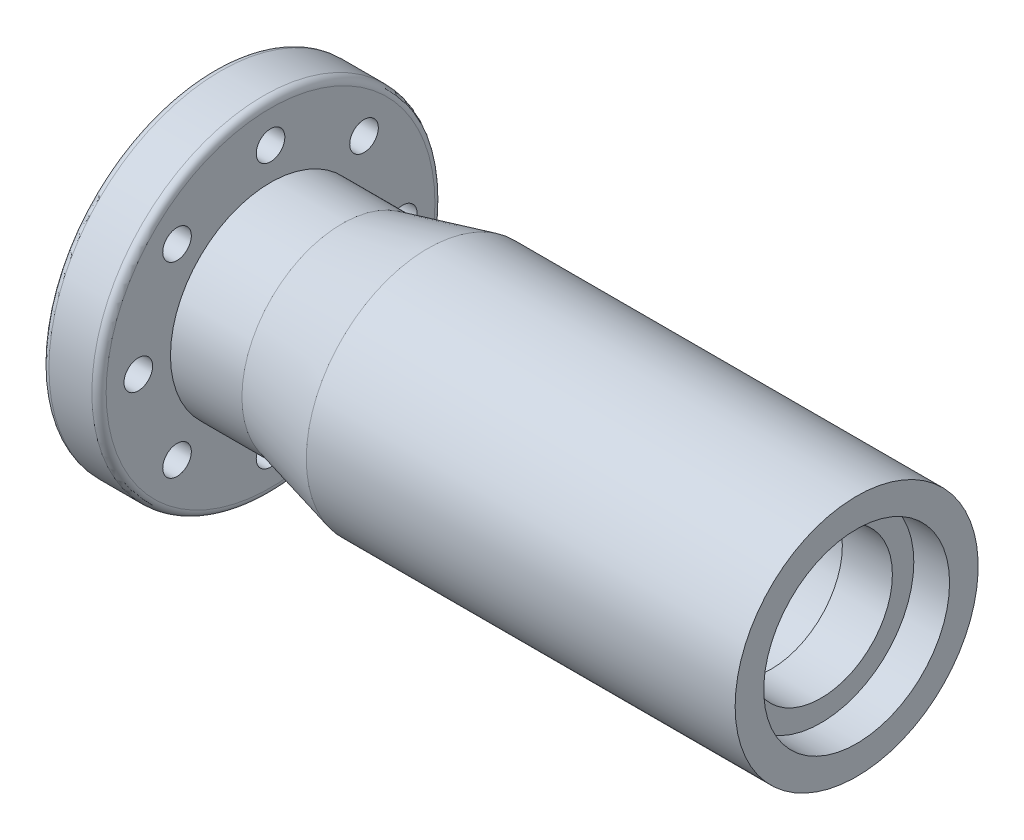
from build123d import *

# Parameters (mm, degrees)
ESQUISSE3_R                  = 13
ENL_V_MAT_EXTRU_1_DEPTH      = 5
ESQUISSE4_R                  = 10
ENL_V_MAT_EXTRU_2_DEPTH      = 92.525952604
ESQUISSE5_R                  = 11.5
ENL_V_MAT_EXTRU_3_DEPTH      = 78
CHANFREIN1_SIZE              = 1
ESQUISSE6_R                  = 2
ENL_V_MAT_EXTRU_4_DEPTH      = 10
R_P_TITION_CIRCULAIRE1_COUNT = 8
CONG_1_R                     = 1


with BuildPart() as part:
    # Esquisse1 → R_volution1 (revolve)
    with BuildSketch(Plane.XY, mode=Mode.PRIVATE) as r_volution1_sk:
        Polygon((0, 0), (0, 24), (8, 24), (8, 14), (18, 14), (30, 17), (90, 17), (90, 0), align=None)
    revolve(r_volution1_sk.sketch.rotate(Axis((0, 0, 0), (1, 0, 0)), 90), axis=Axis((0, 0, 0), (1, 0, 0)))

    # Esquisse3 → Enl_v. mat.-Extru.1 (cut)
    with BuildSketch(Plane(origin=(90, 0, 0), x_dir=(0, 0, -1), z_dir=(1, 0, 0))):
        Circle(ESQUISSE3_R)
    extrude(amount=-ENL_V_MAT_EXTRU_1_DEPTH, mode=Mode.SUBTRACT)

    # Esquisse4 → Enl_v. mat.-Extru.2 (cut, through all)
    with BuildSketch(Plane(origin=(85, 0, 0), x_dir=(0, 0, -1), z_dir=(1, 0, 0))):
        Circle(ESQUISSE4_R)
    extrude(amount=-ENL_V_MAT_EXTRU_2_DEPTH, mode=Mode.SUBTRACT)

    # Esquisse5 → Enl_v. mat.-Extru.3 (cut)
    with BuildSketch(Plane.ZY):
        Circle(ESQUISSE5_R)
    extrude(amount=-ENL_V_MAT_EXTRU_3_DEPTH, mode=Mode.SUBTRACT)

    # Chanfrein1
    chanfrein1_edges = [part.edges().sort_by_distance(p)[0] for p in [
        (0, 0, -11.5),
    ]]
    chamfer(chanfrein1_edges, length=CHANFREIN1_SIZE)

    # Esquisse6 → Enl_v. mat.-Extru.4 (cut)
    with BuildSketch(Plane.ZY):
        with Locations((0, 18.5)):
            Circle(ESQUISSE6_R)
    enl_v_mat_extru_4 = extrude(amount=-ENL_V_MAT_EXTRU_4_DEPTH, mode=Mode.SUBTRACT)

    # R_p_tition circulaire1: Enl_v. mat.-Extru.4 ×8 about axis
    r_p_tition_circulaire1_axis = Axis((0, 0, 0), (1, 0, 0))
    for i in range(1, R_P_TITION_CIRCULAIRE1_COUNT):
        add(enl_v_mat_extru_4.rotate(r_p_tition_circulaire1_axis, i * 360 / R_P_TITION_CIRCULAIRE1_COUNT), mode=Mode.SUBTRACT)

    # Cong_1
    cong_1_edges = [part.edges().sort_by_distance(p)[0] for p in [
        (8, 0, -24),
        (0, 0, -24),
    ]]
    fillet(cong_1_edges, radius=CONG_1_R)


solid = part.part
